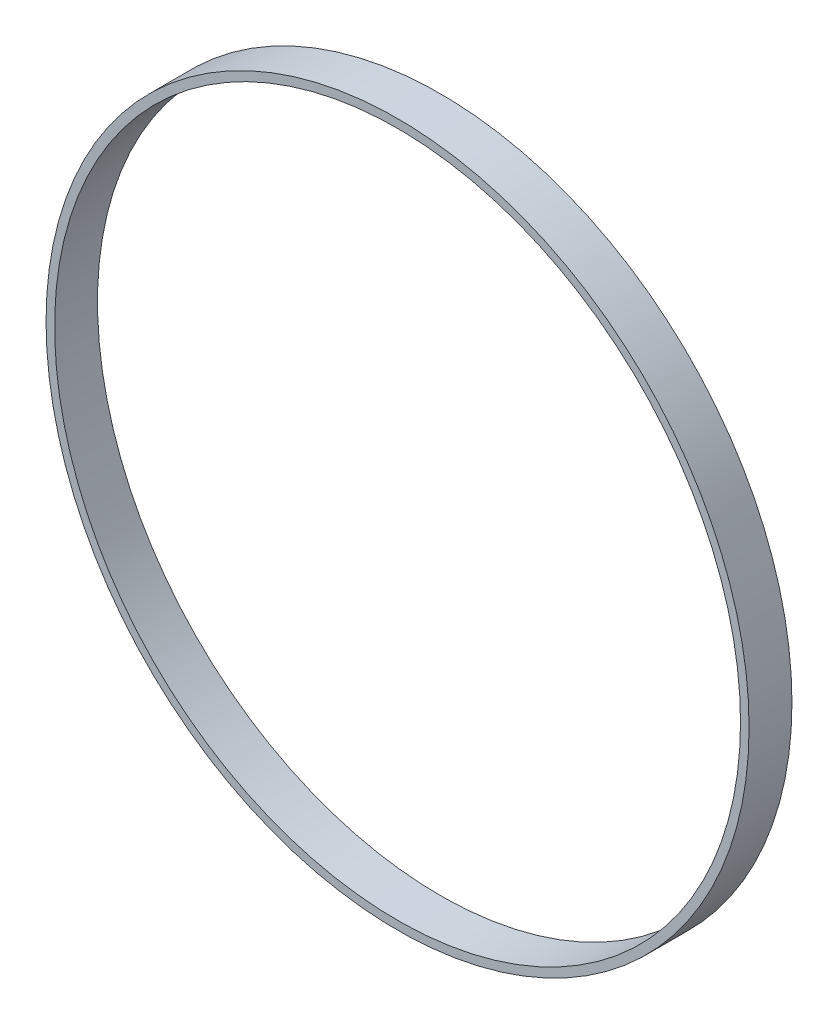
ISO-10303-21;
HEADER;
FILE_DESCRIPTION(('STEP AP214'),'2;1');
FILE_NAME('part.step','',(''),(''),'','','');
FILE_SCHEMA(('AUTOMOTIVE_DESIGN { 1 0 10303 214 1 1 1 1 }'));
ENDSEC;
DATA;
#1=APPLICATION_CONTEXT('core data for automotive mechanical design processes');
#2=APPLICATION_PROTOCOL_DEFINITION('international standard','automotive_design',2000,#1);
#3=PRODUCT_CONTEXT('',#1,'mechanical');
#4=PRODUCT('Part','Part','',(#3));
#5=PRODUCT_RELATED_PRODUCT_CATEGORY('part','',(#4));
#6=PRODUCT_DEFINITION_FORMATION('','',#4);
#7=PRODUCT_DEFINITION_CONTEXT('part definition',#1,'design');
#8=PRODUCT_DEFINITION('design','',#6,#7);
#9=PRODUCT_DEFINITION_SHAPE('','',#8);
#10=(LENGTH_UNIT() NAMED_UNIT(*) SI_UNIT(.MILLI.,.METRE.));
#11=(NAMED_UNIT(*) PLANE_ANGLE_UNIT() SI_UNIT($,.RADIAN.));
#12=(NAMED_UNIT(*) SI_UNIT($,.STERADIAN.) SOLID_ANGLE_UNIT());
#13=UNCERTAINTY_MEASURE_WITH_UNIT(LENGTH_MEASURE(1.E-05),#10,'distance_accuracy_value','');
#14=(GEOMETRIC_REPRESENTATION_CONTEXT(3) GLOBAL_UNCERTAINTY_ASSIGNED_CONTEXT((#13)) GLOBAL_UNIT_ASSIGNED_CONTEXT((#10,
#11,#12)) REPRESENTATION_CONTEXT('',''));
#15=CARTESIAN_POINT('',(0.,0.,0.));
#16=DIRECTION('',(0.,0.,1.));
#17=DIRECTION('',(1.,0.,0.));
#18=AXIS2_PLACEMENT_3D('',#15,#16,#17);
#19=CARTESIAN_POINT('',(0.,0.,5.));
#20=DIRECTION('',(0.,0.,1.));
#21=DIRECTION('',(1.,0.,0.));
#22=AXIS2_PLACEMENT_3D('',#19,#20,#21);
#23=PLANE('',#22);
#24=CARTESIAN_POINT('',(0.,0.,5.));
#25=DIRECTION('',(0.,0.,1.));
#26=DIRECTION('',(1.,0.,0.));
#27=AXIS2_PLACEMENT_3D('',#24,#25,#26);
#28=CIRCLE('',#27,41.);
#29=CARTESIAN_POINT('',(41.,0.,5.));
#30=VERTEX_POINT('',#29);
#31=EDGE_CURVE('E10',#30,#30,#28,.T.);
#32=ORIENTED_EDGE('',*,*,#31,.T.);
#33=EDGE_LOOP('',(#32));
#34=FACE_BOUND('',#33,.T.);
#35=CARTESIAN_POINT('',(0.,0.,5.));
#36=DIRECTION('',(0.,0.,1.));
#37=DIRECTION('',(1.,0.,0.));
#38=AXIS2_PLACEMENT_3D('',#35,#36,#37);
#39=CIRCLE('',#38,40.);
#40=CARTESIAN_POINT('',(40.,0.,5.));
#41=VERTEX_POINT('',#40);
#42=EDGE_CURVE('E35',#41,#41,#39,.T.);
#43=ORIENTED_EDGE('',*,*,#42,.F.);
#44=EDGE_LOOP('',(#43));
#45=FACE_BOUND('',#44,.T.);
#46=ADVANCED_FACE('F24',(#34,#45),#23,.T.);
#47=CARTESIAN_POINT('',(0.,0.,0.));
#48=DIRECTION('',(0.,0.,1.));
#49=DIRECTION('',(1.,0.,0.));
#50=AXIS2_PLACEMENT_3D('',#47,#48,#49);
#51=PLANE('',#50);
#52=CARTESIAN_POINT('',(0.,0.,0.));
#53=DIRECTION('',(0.,0.,1.));
#54=DIRECTION('',(1.,0.,0.));
#55=AXIS2_PLACEMENT_3D('',#52,#53,#54);
#56=CIRCLE('',#55,41.);
#57=CARTESIAN_POINT('',(41.,0.,0.));
#58=VERTEX_POINT('',#57);
#59=EDGE_CURVE('E31',#58,#58,#56,.T.);
#60=ORIENTED_EDGE('',*,*,#59,.F.);
#61=EDGE_LOOP('',(#60));
#62=FACE_BOUND('',#61,.T.);
#63=CARTESIAN_POINT('',(0.,0.,0.));
#64=DIRECTION('',(0.,0.,1.));
#65=DIRECTION('',(1.,0.,0.));
#66=AXIS2_PLACEMENT_3D('',#63,#64,#65);
#67=CIRCLE('',#66,40.);
#68=CARTESIAN_POINT('',(40.,0.,0.));
#69=VERTEX_POINT('',#68);
#70=EDGE_CURVE('E39',#69,#69,#67,.T.);
#71=ORIENTED_EDGE('',*,*,#70,.T.);
#72=EDGE_LOOP('',(#71));
#73=FACE_BOUND('',#72,.T.);
#74=ADVANCED_FACE('F45',(#62,#73),#51,.F.);
#75=CARTESIAN_POINT('',(0.,0.,5.));
#76=DIRECTION('',(0.,0.,-1.));
#77=DIRECTION('',(-1.,0.,0.));
#78=AXIS2_PLACEMENT_3D('',#75,#76,#77);
#79=CYLINDRICAL_SURFACE('',#78,41.);
#80=ORIENTED_EDGE('',*,*,#31,.F.);
#81=EDGE_LOOP('',(#80));
#82=FACE_BOUND('',#81,.T.);
#83=ORIENTED_EDGE('',*,*,#59,.T.);
#84=EDGE_LOOP('',(#83));
#85=FACE_BOUND('',#84,.T.);
#86=ADVANCED_FACE('F26',(#82,#85),#79,.T.);
#87=CARTESIAN_POINT('',(0.,0.,5.));
#88=DIRECTION('',(0.,0.,-1.));
#89=DIRECTION('',(-1.,0.,0.));
#90=AXIS2_PLACEMENT_3D('',#87,#88,#89);
#91=CYLINDRICAL_SURFACE('',#90,40.);
#92=ORIENTED_EDGE('',*,*,#42,.T.);
#93=EDGE_LOOP('',(#92));
#94=FACE_BOUND('',#93,.T.);
#95=ORIENTED_EDGE('',*,*,#70,.F.);
#96=EDGE_LOOP('',(#95));
#97=FACE_BOUND('',#96,.T.);
#98=ADVANCED_FACE('F47',(#94,#97),#91,.F.);
#99=CLOSED_SHELL('',(#46,#74,#86,#98));
#100=MANIFOLD_SOLID_BREP('B2',#99);
#101=ADVANCED_BREP_SHAPE_REPRESENTATION('',(#18,#100),#14);
#102=SHAPE_DEFINITION_REPRESENTATION(#9,#101);
ENDSEC;
END-ISO-10303-21;
